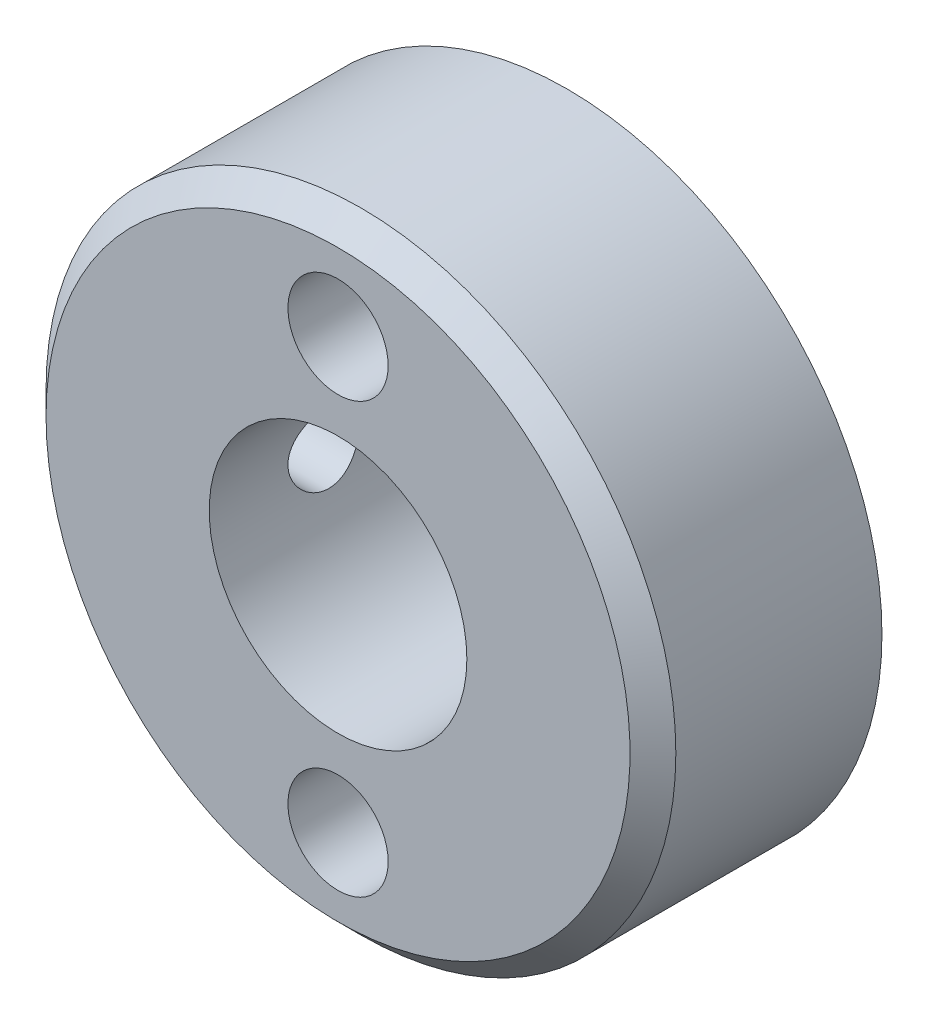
ISO-10303-21;
HEADER;
FILE_DESCRIPTION(('STEP AP214'),'2;1');
FILE_NAME('part.step','',(''),(''),'','','');
FILE_SCHEMA(('AUTOMOTIVE_DESIGN { 1 0 10303 214 1 1 1 1 }'));
ENDSEC;
DATA;
#1=APPLICATION_CONTEXT('core data for automotive mechanical design processes');
#2=APPLICATION_PROTOCOL_DEFINITION('international standard','automotive_design',2000,#1);
#3=PRODUCT_CONTEXT('',#1,'mechanical');
#4=PRODUCT('Part','Part','',(#3));
#5=PRODUCT_RELATED_PRODUCT_CATEGORY('part','',(#4));
#6=PRODUCT_DEFINITION_FORMATION('','',#4);
#7=PRODUCT_DEFINITION_CONTEXT('part definition',#1,'design');
#8=PRODUCT_DEFINITION('design','',#6,#7);
#9=PRODUCT_DEFINITION_SHAPE('','',#8);
#10=(LENGTH_UNIT() NAMED_UNIT(*) SI_UNIT(.MILLI.,.METRE.));
#11=(NAMED_UNIT(*) PLANE_ANGLE_UNIT() SI_UNIT($,.RADIAN.));
#12=(NAMED_UNIT(*) SI_UNIT($,.STERADIAN.) SOLID_ANGLE_UNIT());
#13=UNCERTAINTY_MEASURE_WITH_UNIT(LENGTH_MEASURE(1.E-05),#10,'distance_accuracy_value','');
#14=(GEOMETRIC_REPRESENTATION_CONTEXT(3) GLOBAL_UNCERTAINTY_ASSIGNED_CONTEXT((#13)) GLOBAL_UNIT_ASSIGNED_CONTEXT((#10,
#11,#12)) REPRESENTATION_CONTEXT('',''));
#15=CARTESIAN_POINT('',(0.,0.,0.));
#16=DIRECTION('',(0.,0.,1.));
#17=DIRECTION('',(1.,0.,0.));
#18=AXIS2_PLACEMENT_3D('',#15,#16,#17);
#19=CARTESIAN_POINT('',(0.,0.,0.));
#20=DIRECTION('',(0.,0.,1.));
#21=DIRECTION('',(1.,0.,0.));
#22=AXIS2_PLACEMENT_3D('',#19,#20,#21);
#23=PLANE('',#22);
#24=CARTESIAN_POINT('',(0.,7.5,0.));
#25=DIRECTION('',(0.,0.,1.));
#26=DIRECTION('',(1.,0.,0.));
#27=AXIS2_PLACEMENT_3D('',#24,#25,#26);
#28=CIRCLE('',#27,1.75);
#29=CARTESIAN_POINT('',(1.75,7.5,0.));
#30=VERTEX_POINT('',#29);
#31=EDGE_CURVE('E123',#30,#30,#28,.T.);
#32=ORIENTED_EDGE('',*,*,#31,.F.);
#33=EDGE_LOOP('',(#32));
#34=FACE_BOUND('',#33,.T.);
#35=CARTESIAN_POINT('',(0.,0.,0.));
#36=DIRECTION('',(0.,0.,1.));
#37=DIRECTION('',(1.,0.,0.));
#38=AXIS2_PLACEMENT_3D('',#35,#36,#37);
#39=CIRCLE('',#38,4.5);
#40=CARTESIAN_POINT('',(4.5,0.,0.));
#41=VERTEX_POINT('',#40);
#42=EDGE_CURVE('E121',#41,#41,#39,.T.);
#43=ORIENTED_EDGE('',*,*,#42,.F.);
#44=EDGE_LOOP('',(#43));
#45=FACE_BOUND('',#44,.T.);
#46=CARTESIAN_POINT('',(0.,0.,0.));
#47=DIRECTION('',(0.,0.,1.));
#48=DIRECTION('',(1.,0.,0.));
#49=AXIS2_PLACEMENT_3D('',#46,#47,#48);
#50=CIRCLE('',#49,10.2);
#51=CARTESIAN_POINT('',(-10.2,0.,0.));
#52=VERTEX_POINT('',#51);
#53=EDGE_CURVE('E48',#52,#52,#50,.T.);
#54=ORIENTED_EDGE('',*,*,#53,.T.);
#55=EDGE_LOOP('',(#54));
#56=FACE_BOUND('',#55,.T.);
#57=CARTESIAN_POINT('',(0.,-7.5,0.));
#58=DIRECTION('',(0.,0.,-1.));
#59=DIRECTION('',(1.,0.,0.));
#60=AXIS2_PLACEMENT_3D('',#57,#58,#59);
#61=CIRCLE('',#60,1.75);
#62=CARTESIAN_POINT('',(1.75,-7.5,0.));
#63=VERTEX_POINT('',#62);
#64=EDGE_CURVE('E89',#63,#63,#61,.T.);
#65=ORIENTED_EDGE('',*,*,#64,.T.);
#66=EDGE_LOOP('',(#65));
#67=FACE_BOUND('',#66,.T.);
#68=ADVANCED_FACE('F35',(#34,#45,#56,#67),#23,.T.);
#69=CARTESIAN_POINT('',(0.,0.,-8.));
#70=DIRECTION('',(0.,0.,1.));
#71=DIRECTION('',(1.,0.,0.));
#72=AXIS2_PLACEMENT_3D('',#69,#70,#71);
#73=CYLINDRICAL_SURFACE('',#72,11.);
#74=CARTESIAN_POINT('',(-11.,0.,-5.25));
#75=CARTESIAN_POINT('',(-10.999999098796,-0.069971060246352,-5.24999699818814));
#76=CARTESIAN_POINT('',(-10.9993252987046,-0.139987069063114,-5.24410506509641));
#77=CARTESIAN_POINT('',(-10.996702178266,-0.27807424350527,-5.2206920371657));
#78=CARTESIAN_POINT('',(-10.9947514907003,-0.346143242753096,-5.20315847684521));
#79=CARTESIAN_POINT('',(-10.9897945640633,-0.478317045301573,-5.15698245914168));
#80=CARTESIAN_POINT('',(-10.9867890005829,-0.542424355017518,-5.12834711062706));
#81=CARTESIAN_POINT('',(-10.9800574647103,-0.664910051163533,-5.06079510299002));
#82=CARTESIAN_POINT('',(-10.9763316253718,-0.723289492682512,-5.02188034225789));
#83=CARTESIAN_POINT('',(-10.968557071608,-0.832943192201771,-4.93468294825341));
#84=CARTESIAN_POINT('',(-10.9645070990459,-0.884187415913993,-4.88636265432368));
#85=CARTESIAN_POINT('',(-10.9565510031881,-0.9778576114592,-4.78180649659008));
#86=CARTESIAN_POINT('',(-10.9526448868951,-1.0202831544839,-4.72557024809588));
#87=CARTESIAN_POINT('',(-10.9454062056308,-1.09522113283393,-4.60658651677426));
#88=CARTESIAN_POINT('',(-10.9420752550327,-1.12770585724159,-4.54382147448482));
#89=CARTESIAN_POINT('',(-10.9363802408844,-1.18166312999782,-4.41368303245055));
#90=CARTESIAN_POINT('',(-10.9340161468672,-1.20313602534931,-4.34630977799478));
#91=CARTESIAN_POINT('',(-10.9305342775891,-1.23436981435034,-4.20917683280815));
#92=CARTESIAN_POINT('',(-10.9294111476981,-1.24418104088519,-4.13942874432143));
#93=CARTESIAN_POINT('',(-10.928521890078,-1.25196865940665,-3.99926759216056));
#94=CARTESIAN_POINT('',(-10.9287557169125,-1.24994544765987,-3.92885455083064));
#95=CARTESIAN_POINT('',(-10.9305490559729,-1.23416301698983,-3.7897111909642));
#96=CARTESIAN_POINT('',(-10.9321023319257,-1.22045900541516,-3.72097451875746));
#97=CARTESIAN_POINT('',(-10.9363498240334,-1.18179000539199,-3.58678297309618));
#98=CARTESIAN_POINT('',(-10.9390440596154,-1.15682482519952,-3.52132815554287));
#99=CARTESIAN_POINT('',(-10.9452770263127,-1.09628205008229,-3.39538543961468));
#100=CARTESIAN_POINT('',(-10.9488176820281,-1.0606802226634,-3.33490928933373));
#101=CARTESIAN_POINT('',(-10.9563429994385,-0.979892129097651,-3.22076925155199));
#102=CARTESIAN_POINT('',(-10.9603276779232,-0.934705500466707,-3.16710562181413));
#103=CARTESIAN_POINT('',(-10.9683198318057,-0.83572337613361,-3.06779331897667));
#104=CARTESIAN_POINT('',(-10.9723273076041,-0.781880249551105,-3.02219210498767));
#105=CARTESIAN_POINT('',(-10.9798921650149,-0.667278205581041,-2.94066779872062));
#106=CARTESIAN_POINT('',(-10.9834495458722,-0.606519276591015,-2.90474472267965));
#107=CARTESIAN_POINT('',(-10.9897150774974,-0.479775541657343,-2.84359731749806));
#108=CARTESIAN_POINT('',(-10.9924230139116,-0.413789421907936,-2.818375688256));
#109=CARTESIAN_POINT('',(-10.9966825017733,-0.27848120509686,-2.77938340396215));
#110=CARTESIAN_POINT('',(-10.9982340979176,-0.209159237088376,-2.76561230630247));
#111=CARTESIAN_POINT('',(-11.0000003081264,-0.0695577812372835,-2.74997287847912));
#112=CARTESIAN_POINT('',(-11.0002222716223,0.000714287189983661,-2.74803911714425));
#113=CARTESIAN_POINT('',(-10.9993239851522,0.140581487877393,-2.75595697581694));
#114=CARTESIAN_POINT('',(-10.9982037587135,0.210176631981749,-2.76580838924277));
#115=CARTESIAN_POINT('',(-10.994751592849,0.346523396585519,-2.79696262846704));
#116=CARTESIAN_POINT('',(-10.9924229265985,0.413282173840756,-2.81823452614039));
#117=CARTESIAN_POINT('',(-10.9868148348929,0.542284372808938,-2.87159392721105));
#118=CARTESIAN_POINT('',(-10.9835353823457,0.604527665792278,-2.90368173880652));
#119=CARTESIAN_POINT('',(-10.9763735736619,0.72302600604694,-2.97792232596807));
#120=CARTESIAN_POINT('',(-10.9724886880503,0.77925417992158,-3.02011774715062));
#121=CARTESIAN_POINT('',(-10.9645592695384,0.883853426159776,-3.11331505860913));
#122=CARTESIAN_POINT('',(-10.9605147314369,0.932224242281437,-3.16431723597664));
#123=CARTESIAN_POINT('',(-10.9526994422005,1.01996547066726,-3.27396722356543));
#124=CARTESIAN_POINT('',(-10.9489300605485,1.05929271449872,-3.33264968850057));
#125=CARTESIAN_POINT('',(-10.942113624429,1.12753292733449,-3.45582498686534));
#126=CARTESIAN_POINT('',(-10.9390665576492,1.1564460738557,-3.5203177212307));
#127=CARTESIAN_POINT('',(-10.9340487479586,1.20296631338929,-3.65313935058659));
#128=CARTESIAN_POINT('',(-10.9320756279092,1.22059839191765,-3.72145940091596));
#129=CARTESIAN_POINT('',(-10.9294220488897,1.2441367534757,-3.86011418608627));
#130=CARTESIAN_POINT('',(-10.9287415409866,1.25004348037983,-3.93044884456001));
#131=CARTESIAN_POINT('',(-10.9287514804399,1.24995628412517,-4.07070705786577));
#132=CARTESIAN_POINT('',(-10.9294341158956,1.2440301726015,-4.14063066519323));
#133=CARTESIAN_POINT('',(-10.9320766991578,1.22058843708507,-4.27848162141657));
#134=CARTESIAN_POINT('',(-10.9340366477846,1.20307280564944,-4.34640896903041));
#135=CARTESIAN_POINT('',(-10.9390107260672,1.15696926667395,-4.4783342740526));
#136=CARTESIAN_POINT('',(-10.9420246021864,1.12838402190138,-4.5423331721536));
#137=CARTESIAN_POINT('',(-10.9487674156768,1.06095945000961,-4.66463624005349));
#138=CARTESIAN_POINT('',(-10.9524963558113,1.0221200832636,-4.72294038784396));
#139=CARTESIAN_POINT('',(-10.9602747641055,0.935036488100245,-4.83254612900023));
#140=CARTESIAN_POINT('',(-10.96432588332,0.886741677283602,-4.8838074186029));
#141=CARTESIAN_POINT('',(-10.972277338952,0.782221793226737,-4.97752568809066));
#142=CARTESIAN_POINT('',(-10.9761776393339,0.725994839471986,-5.01998057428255));
#143=CARTESIAN_POINT('',(-10.9834013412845,0.607005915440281,-5.09499201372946));
#144=CARTESIAN_POINT('',(-10.9867228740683,0.54422378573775,-5.12751674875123));
#145=CARTESIAN_POINT('',(-10.9923953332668,0.414088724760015,-5.18151706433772));
#146=CARTESIAN_POINT('',(-10.9947473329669,0.346740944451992,-5.20300486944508));
#147=CARTESIAN_POINT('',(-10.9976371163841,0.232523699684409,-5.2290739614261));
#148=CARTESIAN_POINT('',(-10.9985189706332,0.18637950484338,-5.23691021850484));
#149=CARTESIAN_POINT('',(-10.9997007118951,0.0934968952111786,-5.24737422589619));
#150=CARTESIAN_POINT('',(-11.0000006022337,0.0467584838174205,-5.25000200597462));
#151=CARTESIAN_POINT('',(-11.,0.,-5.25));
#152=B_SPLINE_CURVE_WITH_KNOTS('',3,(#74,#75,#76,#77,#78,#79,#80,#81,#82,#83,#84,#85,#86,#87,
#88,#89,#90,#91,#92,#93,#94,#95,#96,#97,#98,#99,#100,#101,#102,#103,#104,#105,#106,#107,#108,
#109,#110,#111,#112,#113,#114,#115,#116,#117,#118,#119,#120,#121,#122,#123,#124,#125,#126,#127,
#128,#129,#130,#131,#132,#133,#134,#135,#136,#137,#138,#139,#140,#141,#142,#143,#144,#145,#146,
#147,#148,#149,#150,#151),.UNSPECIFIED.,.T.,.F.,(4,2,2,2,2,2,2,2,2,2,2,2,2,2,2,2,2,2,2,2,2,2,2,
2,2,2,2,2,2,2,2,2,2,2,2,2,2,2,4),(0.,0.209742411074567,0.419709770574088,0.629542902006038,
0.839337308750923,1.04998970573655,1.26065234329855,1.47189698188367,1.68313496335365,
1.89345787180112,2.10377373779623,2.31310105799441,2.52243194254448,2.73224341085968,
2.94206281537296,3.15307892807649,3.36409539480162,3.57516506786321,3.78622658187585,
3.99612038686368,4.20601051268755,4.41533507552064,4.62466560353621,4.83489538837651,
5.04513202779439,5.25635228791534,5.4675689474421,5.67831616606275,5.88905540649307,
6.09859040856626,6.30812554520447,6.51761030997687,6.72709588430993,6.9377343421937,
7.14842282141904,7.35977947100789,7.57090151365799,7.71106364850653,7.85122498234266),.UNSPECIFIED.);
#153=CARTESIAN_POINT('',(-11.,0.,-5.25));
#154=VERTEX_POINT('',#153);
#155=EDGE_CURVE('E82',#154,#154,#152,.T.);
#156=ORIENTED_EDGE('',*,*,#155,.F.);
#157=EDGE_LOOP('',(#156));
#158=FACE_BOUND('',#157,.T.);
#159=CARTESIAN_POINT('',(0.,0.,-0.799999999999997));
#160=DIRECTION('',(0.,0.,1.));
#161=DIRECTION('',(1.,0.,0.));
#162=AXIS2_PLACEMENT_3D('',#159,#160,#161);
#163=CIRCLE('',#162,11.);
#164=CARTESIAN_POINT('',(-11.,0.,-0.799999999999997));
#165=VERTEX_POINT('',#164);
#166=EDGE_CURVE('E11',#165,#165,#163,.F.);
#167=ORIENTED_EDGE('',*,*,#166,.T.);
#168=EDGE_LOOP('',(#167));
#169=FACE_BOUND('',#168,.T.);
#170=CARTESIAN_POINT('',(0.,0.,-8.));
#171=DIRECTION('',(0.,0.,1.));
#172=DIRECTION('',(1.,0.,0.));
#173=AXIS2_PLACEMENT_3D('',#170,#171,#172);
#174=CIRCLE('',#173,11.);
#175=CARTESIAN_POINT('',(11.,0.,-8.));
#176=VERTEX_POINT('',#175);
#177=EDGE_CURVE('E122',#176,#176,#174,.T.);
#178=ORIENTED_EDGE('',*,*,#177,.T.);
#179=EDGE_LOOP('',(#178));
#180=FACE_BOUND('',#179,.T.);
#181=ADVANCED_FACE('F67',(#158,#169,#180),#73,.T.);
#182=CARTESIAN_POINT('',(0.,0.,-8.));
#183=DIRECTION('',(0.,0.,1.));
#184=DIRECTION('',(1.,0.,0.));
#185=AXIS2_PLACEMENT_3D('',#182,#183,#184);
#186=PLANE('',#185);
#187=CARTESIAN_POINT('',(0.,0.,-8.));
#188=DIRECTION('',(0.,0.,1.));
#189=DIRECTION('',(1.,0.,0.));
#190=AXIS2_PLACEMENT_3D('',#187,#188,#189);
#191=CIRCLE('',#190,5.3);
#192=CARTESIAN_POINT('',(5.3,0.,-8.));
#193=VERTEX_POINT('',#192);
#194=EDGE_CURVE('E126',#193,#193,#191,.T.);
#195=ORIENTED_EDGE('',*,*,#194,.T.);
#196=EDGE_LOOP('',(#195));
#197=FACE_BOUND('',#196,.T.);
#198=ORIENTED_EDGE('',*,*,#177,.F.);
#199=EDGE_LOOP('',(#198));
#200=FACE_BOUND('',#199,.T.);
#201=ADVANCED_FACE('F73',(#197,#200),#186,.F.);
#202=CARTESIAN_POINT('',(0.,0.,-8.));
#203=DIRECTION('',(0.,0.,1.));
#204=DIRECTION('',(1.,0.,0.));
#205=AXIS2_PLACEMENT_3D('',#202,#203,#204);
#206=CYLINDRICAL_SURFACE('',#205,4.5);
#207=CARTESIAN_POINT('',(-4.5,0.,-5.25));
#208=CARTESIAN_POINT('',(-4.49999908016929,-0.0688012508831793,-5.24999860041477));
#209=CARTESIAN_POINT('',(-4.49840674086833,-0.137617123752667,-5.24430068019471));
#210=CARTESIAN_POINT('',(-4.49220950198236,-0.273259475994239,-5.22170427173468));
#211=CARTESIAN_POINT('',(-4.48760333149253,-0.340085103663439,-5.20480105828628));
#212=CARTESIAN_POINT('',(-4.47588565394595,-0.469769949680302,-5.16039128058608));
#213=CARTESIAN_POINT('',(-4.46877753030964,-0.53263439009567,-5.13289903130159));
#214=CARTESIAN_POINT('',(-4.45280312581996,-0.652860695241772,-5.06814649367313));
#215=CARTESIAN_POINT('',(-4.44393668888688,-0.710222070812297,-5.03088533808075));
#216=CARTESIAN_POINT('',(-4.4251515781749,-0.819246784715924,-4.94667056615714));
#217=CARTESIAN_POINT('',(-4.41521373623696,-0.870753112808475,-4.89951796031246));
#218=CARTESIAN_POINT('',(-4.39552607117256,-0.965238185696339,-4.79728372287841));
#219=CARTESIAN_POINT('',(-4.38577627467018,-1.00821573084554,-4.74220097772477));
#220=CARTESIAN_POINT('',(-4.36737044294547,-1.08520808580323,-4.62439273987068));
#221=CARTESIAN_POINT('',(-4.35873847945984,-1.11903874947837,-4.56154279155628));
#222=CARTESIAN_POINT('',(-4.34382900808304,-1.1755895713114,-4.43076808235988));
#223=CARTESIAN_POINT('',(-4.33755102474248,-1.19831197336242,-4.36284434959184));
#224=CARTESIAN_POINT('',(-4.32825883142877,-1.23144924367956,-4.22559721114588));
#225=CARTESIAN_POINT('',(-4.32516886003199,-1.24215036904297,-4.15634817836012));
#226=CARTESIAN_POINT('',(-4.32237649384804,-1.25183427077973,-4.01697411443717));
#227=CARTESIAN_POINT('',(-4.3226734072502,-1.25081944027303,-3.9468492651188));
#228=CARTESIAN_POINT('',(-4.32655366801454,-1.2373267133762,-3.80997772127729));
#229=CARTESIAN_POINT('',(-4.33003660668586,-1.22519902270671,-3.74319319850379));
#230=CARTESIAN_POINT('',(-4.33973517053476,-1.19038731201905,-3.6126463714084));
#231=CARTESIAN_POINT('',(-4.34595103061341,-1.16770238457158,-3.54888432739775));
#232=CARTESIAN_POINT('',(-4.36050069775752,-1.11214373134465,-3.42529776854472));
#233=CARTESIAN_POINT('',(-4.36885918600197,-1.07915021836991,-3.36553013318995));
#234=CARTESIAN_POINT('',(-4.386739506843,-1.00399440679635,-3.25225842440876));
#235=CARTESIAN_POINT('',(-4.39626158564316,-0.961830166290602,-3.19875568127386));
#236=CARTESIAN_POINT('',(-4.41581072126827,-0.867755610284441,-3.09753611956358));
#237=CARTESIAN_POINT('',(-4.42584370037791,-0.815552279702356,-3.05009236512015));
#238=CARTESIAN_POINT('',(-4.44498199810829,-0.703806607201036,-2.96457426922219));
#239=CARTESIAN_POINT('',(-4.45408727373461,-0.644263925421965,-2.92650036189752));
#240=CARTESIAN_POINT('',(-4.47040839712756,-0.519083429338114,-2.86066818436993));
#241=CARTESIAN_POINT('',(-4.47761448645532,-0.453416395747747,-2.83296289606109));
#242=CARTESIAN_POINT('',(-4.48925492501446,-0.318109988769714,-2.78906590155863));
#243=CARTESIAN_POINT('',(-4.493689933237,-0.24847156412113,-2.77287145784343));
#244=CARTESIAN_POINT('',(-4.49918736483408,-0.109526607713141,-2.75289286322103));
#245=CARTESIAN_POINT('',(-4.5003505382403,-0.0402773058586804,-2.74873785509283));
#246=CARTESIAN_POINT('',(-4.4994648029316,0.0979299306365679,-2.75192699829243));
#247=CARTESIAN_POINT('',(-4.49741625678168,0.166887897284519,-2.75926985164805));
#248=CARTESIAN_POINT('',(-4.49040265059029,0.301206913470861,-2.78494333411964));
#249=CARTESIAN_POINT('',(-4.48549337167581,0.366611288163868,-2.80306394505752));
#250=CARTESIAN_POINT('',(-4.47331829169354,0.493443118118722,-2.8495318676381));
#251=CARTESIAN_POINT('',(-4.46605222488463,0.554870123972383,-2.87788033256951));
#252=CARTESIAN_POINT('',(-4.44973740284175,0.673420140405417,-2.94466587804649));
#253=CARTESIAN_POINT('',(-4.44065471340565,0.730427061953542,-2.98330052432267));
#254=CARTESIAN_POINT('',(-4.42175477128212,0.837277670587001,-3.06931613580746));
#255=CARTESIAN_POINT('',(-4.41193736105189,0.887119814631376,-3.11669898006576));
#256=CARTESIAN_POINT('',(-4.39229842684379,0.979812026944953,-3.22060144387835));
#257=CARTESIAN_POINT('',(-4.3824860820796,1.02239957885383,-3.27735745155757));
#258=CARTESIAN_POINT('',(-4.36429693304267,1.09745581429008,-3.39742063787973));
#259=CARTESIAN_POINT('',(-4.35592007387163,1.12992488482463,-3.4607275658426));
#260=CARTESIAN_POINT('',(-4.34164798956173,1.18358105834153,-3.59180716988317));
#261=CARTESIAN_POINT('',(-4.3357390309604,1.20483077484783,-3.65955263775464));
#262=CARTESIAN_POINT('',(-4.32707876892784,1.23557652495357,-3.79784970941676));
#263=CARTESIAN_POINT('',(-4.32432657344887,1.24507587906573,-3.86840051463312));
#264=CARTESIAN_POINT('',(-4.32237038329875,1.25184859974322,-4.00760577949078));
#265=CARTESIAN_POINT('',(-4.32304340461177,1.24954571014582,-4.07623819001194));
#266=CARTESIAN_POINT('',(-4.32757137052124,1.23377143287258,-4.21209489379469));
#267=CARTESIAN_POINT('',(-4.33142621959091,1.22030038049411,-4.27931922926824));
#268=CARTESIAN_POINT('',(-4.34180718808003,1.18282724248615,-4.40986723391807));
#269=CARTESIAN_POINT('',(-4.34830866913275,1.15892214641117,-4.47322084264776));
#270=CARTESIAN_POINT('',(-4.36324916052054,1.10133451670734,-4.59506742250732));
#271=CARTESIAN_POINT('',(-4.37168849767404,1.06765033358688,-4.65355957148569));
#272=CARTESIAN_POINT('',(-4.38988810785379,0.990206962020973,-4.76602765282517));
#273=CARTESIAN_POINT('',(-4.39968178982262,0.946162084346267,-4.81980147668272));
#274=CARTESIAN_POINT('',(-4.41930831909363,0.849781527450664,-4.91933237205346));
#275=CARTESIAN_POINT('',(-4.42914117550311,0.797443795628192,-4.96508745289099));
#276=CARTESIAN_POINT('',(-4.44801839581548,0.684460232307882,-5.04835813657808));
#277=CARTESIAN_POINT('',(-4.45703841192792,0.623646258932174,-5.08565162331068));
#278=CARTESIAN_POINT('',(-4.47299974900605,0.496361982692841,-5.14942813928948));
#279=CARTESIAN_POINT('',(-4.47994229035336,0.429895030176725,-5.17591751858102));
#280=CARTESIAN_POINT('',(-4.4901607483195,0.3031454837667,-5.2142200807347));
#281=CARTESIAN_POINT('',(-4.49382245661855,0.243364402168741,-5.22760478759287));
#282=CARTESIAN_POINT('',(-4.49874234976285,0.122392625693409,-5.24549484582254));
#283=CARTESIAN_POINT('',(-4.50000081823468,0.0612020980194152,-5.25000124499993));
#284=CARTESIAN_POINT('',(-4.5,0.,-5.25));
#285=B_SPLINE_CURVE_WITH_KNOTS('',3,(#207,#208,#209,#210,#211,#212,#213,#214,#215,#216,#217,
#218,#219,#220,#221,#222,#223,#224,#225,#226,#227,#228,#229,#230,#231,#232,#233,#234,#235,#236,
#237,#238,#239,#240,#241,#242,#243,#244,#245,#246,#247,#248,#249,#250,#251,#252,#253,#254,#255,
#256,#257,#258,#259,#260,#261,#262,#263,#264,#265,#266,#267,#268,#269,#270,#271,#272,#273,#274,
#275,#276,#277,#278,#279,#280,#281,#282,#283,#284),.UNSPECIFIED.,.T.,.F.,(4,2,2,2,2,2,2,2,2,2,2,
2,2,2,2,2,2,2,2,2,2,2,2,2,2,2,2,2,2,2,2,2,2,2,2,2,2,2,4),(0.,0.206179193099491,
0.412445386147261,0.618433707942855,0.824440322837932,1.03507624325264,1.24574177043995,
1.46037690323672,1.67496866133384,1.8843343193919,2.09365721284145,2.29660232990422,
2.49956489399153,2.70497960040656,2.91043784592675,3.12319493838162,3.33596188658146,
3.5498016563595,3.76359055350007,3.97072010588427,4.17782627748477,4.38102317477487,
4.58424299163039,4.79168948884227,4.99918059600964,5.21305991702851,5.42693105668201,
5.63959564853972,5.85220013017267,6.05722599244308,6.26224569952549,6.46539893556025,
6.66858645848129,6.87821913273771,7.0879037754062,7.30258090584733,7.51713167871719,
7.7005598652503,7.88396640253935),.UNSPECIFIED.);
#286=CARTESIAN_POINT('',(-4.5,0.,-5.25));
#287=VERTEX_POINT('',#286);
#288=EDGE_CURVE('E39',#287,#287,#285,.T.);
#289=ORIENTED_EDGE('',*,*,#288,.T.);
#290=EDGE_LOOP('',(#289));
#291=FACE_BOUND('',#290,.T.);
#292=CARTESIAN_POINT('',(0.,0.,-7.2));
#293=DIRECTION('',(0.,0.,1.));
#294=DIRECTION('',(1.,0.,0.));
#295=AXIS2_PLACEMENT_3D('',#292,#293,#294);
#296=CIRCLE('',#295,4.5);
#297=CARTESIAN_POINT('',(4.5,0.,-7.2));
#298=VERTEX_POINT('',#297);
#299=EDGE_CURVE('E118',#298,#298,#296,.F.);
#300=ORIENTED_EDGE('',*,*,#299,.T.);
#301=EDGE_LOOP('',(#300));
#302=FACE_BOUND('',#301,.T.);
#303=ORIENTED_EDGE('',*,*,#42,.T.);
#304=EDGE_LOOP('',(#303));
#305=FACE_BOUND('',#304,.T.);
#306=ADVANCED_FACE('F103',(#291,#302,#305),#206,.F.);
#307=CARTESIAN_POINT('',(0.,7.5,6.07031033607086));
#308=DIRECTION('',(0.,0.,1.));
#309=DIRECTION('',(1.,0.,0.));
#310=AXIS2_PLACEMENT_3D('',#307,#308,#309);
#311=CYLINDRICAL_SURFACE('',#310,1.75);
#312=ORIENTED_EDGE('',*,*,#31,.T.);
#313=EDGE_LOOP('',(#312));
#314=FACE_BOUND('',#313,.T.);
#315=CARTESIAN_POINT('',(0.,7.5,-4.));
#316=DIRECTION('',(0.,0.,1.));
#317=DIRECTION('',(1.,0.,0.));
#318=AXIS2_PLACEMENT_3D('',#315,#316,#317);
#319=CIRCLE('',#318,1.75);
#320=CARTESIAN_POINT('',(1.75,7.5,-4.));
#321=VERTEX_POINT('',#320);
#322=EDGE_CURVE('E88',#321,#321,#319,.T.);
#323=ORIENTED_EDGE('',*,*,#322,.F.);
#324=EDGE_LOOP('',(#323));
#325=FACE_BOUND('',#324,.T.);
#326=ADVANCED_FACE('F100',(#314,#325),#311,.F.);
#327=CARTESIAN_POINT('',(0.,7.5,-5.01036297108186));
#328=DIRECTION('',(0.,0.,1.));
#329=DIRECTION('',(1.,0.,0.));
#330=AXIS2_PLACEMENT_3D('',#327,#328,#329);
#331=CONICAL_SURFACE('',#330,0.,1.04719755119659);
#332=ORIENTED_EDGE('',*,*,#322,.T.);
#333=EDGE_LOOP('',(#332));
#334=FACE_BOUND('',#333,.T.);
#335=CARTESIAN_POINT('',(0.,7.5,-5.01036297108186));
#336=VERTEX_POINT('',#335);
#337=VERTEX_LOOP('',#336);
#338=FACE_BOUND('',#337,.T.);
#339=ADVANCED_FACE('F96',(#334,#338),#331,.F.);
#340=CARTESIAN_POINT('',(0.,0.,-8.));
#341=DIRECTION('',(0.,0.,-1.));
#342=DIRECTION('',(-1.,0.,0.));
#343=AXIS2_PLACEMENT_3D('',#340,#341,#342);
#344=CONICAL_SURFACE('',#343,5.3,0.785398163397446);
#345=ORIENTED_EDGE('',*,*,#299,.F.);
#346=EDGE_LOOP('',(#345));
#347=FACE_BOUND('',#346,.T.);
#348=ORIENTED_EDGE('',*,*,#194,.F.);
#349=EDGE_LOOP('',(#348));
#350=FACE_BOUND('',#349,.T.);
#351=ADVANCED_FACE('F80',(#347,#350),#344,.F.);
#352=CARTESIAN_POINT('',(0.,0.,0.));
#353=DIRECTION('',(0.,0.,-1.));
#354=DIRECTION('',(-1.,0.,0.));
#355=AXIS2_PLACEMENT_3D('',#352,#353,#354);
#356=CONICAL_SURFACE('',#355,10.2,0.785398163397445);
#357=CARTESIAN_POINT('',(-11.,0.,-0.799999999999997));
#358=CARTESIAN_POINT('',(-10.9916666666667,0.,-0.791666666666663));
#359=CARTESIAN_POINT('',(-10.9833333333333,0.,-0.78333333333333));
#360=CARTESIAN_POINT('',(-10.9666666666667,0.,-0.766666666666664));
#361=CARTESIAN_POINT('',(-10.9583333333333,0.,-0.758333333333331));
#362=CARTESIAN_POINT('',(-10.9416666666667,0.,-0.741666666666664));
#363=CARTESIAN_POINT('',(-10.9333333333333,0.,-0.73333333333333));
#364=CARTESIAN_POINT('',(-10.9166666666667,0.,-0.716666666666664));
#365=CARTESIAN_POINT('',(-10.9083333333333,0.,-0.708333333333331));
#366=CARTESIAN_POINT('',(-10.8916666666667,0.,-0.691666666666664));
#367=CARTESIAN_POINT('',(-10.8833333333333,0.,-0.683333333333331));
#368=CARTESIAN_POINT('',(-10.8666666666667,0.,-0.666666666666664));
#369=CARTESIAN_POINT('',(-10.8583333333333,0.,-0.658333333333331));
#370=CARTESIAN_POINT('',(-10.8416666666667,0.,-0.641666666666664));
#371=CARTESIAN_POINT('',(-10.8333333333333,0.,-0.633333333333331));
#372=CARTESIAN_POINT('',(-10.8166666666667,0.,-0.616666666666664));
#373=CARTESIAN_POINT('',(-10.8083333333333,0.,-0.608333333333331));
#374=CARTESIAN_POINT('',(-10.7916666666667,0.,-0.591666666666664));
#375=CARTESIAN_POINT('',(-10.7833333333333,0.,-0.583333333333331));
#376=CARTESIAN_POINT('',(-10.7666666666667,0.,-0.566666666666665));
#377=CARTESIAN_POINT('',(-10.7583333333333,0.,-0.558333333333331));
#378=CARTESIAN_POINT('',(-10.7416666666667,0.,-0.541666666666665));
#379=CARTESIAN_POINT('',(-10.7333333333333,0.,-0.533333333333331));
#380=CARTESIAN_POINT('',(-10.7166666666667,0.,-0.516666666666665));
#381=CARTESIAN_POINT('',(-10.7083333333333,0.,-0.508333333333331));
#382=CARTESIAN_POINT('',(-10.6916666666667,0.,-0.491666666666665));
#383=CARTESIAN_POINT('',(-10.6833333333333,0.,-0.483333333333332));
#384=CARTESIAN_POINT('',(-10.6666666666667,0.,-0.466666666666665));
#385=CARTESIAN_POINT('',(-10.6583333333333,0.,-0.458333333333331));
#386=CARTESIAN_POINT('',(-10.6416666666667,0.,-0.441666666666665));
#387=CARTESIAN_POINT('',(-10.6333333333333,0.,-0.433333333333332));
#388=CARTESIAN_POINT('',(-10.6166666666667,0.,-0.416666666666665));
#389=CARTESIAN_POINT('',(-10.6083333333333,0.,-0.408333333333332));
#390=CARTESIAN_POINT('',(-10.5916666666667,0.,-0.391666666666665));
#391=CARTESIAN_POINT('',(-10.5833333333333,0.,-0.383333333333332));
#392=CARTESIAN_POINT('',(-10.5666666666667,0.,-0.366666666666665));
#393=CARTESIAN_POINT('',(-10.5583333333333,0.,-0.358333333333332));
#394=CARTESIAN_POINT('',(-10.5416666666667,0.,-0.341666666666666));
#395=CARTESIAN_POINT('',(-10.5333333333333,0.,-0.333333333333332));
#396=CARTESIAN_POINT('',(-10.5166666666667,0.,-0.316666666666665));
#397=CARTESIAN_POINT('',(-10.5083333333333,0.,-0.308333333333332));
#398=CARTESIAN_POINT('',(-10.4916666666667,0.,-0.291666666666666));
#399=CARTESIAN_POINT('',(-10.4833333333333,0.,-0.283333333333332));
#400=CARTESIAN_POINT('',(-10.4666666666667,0.,-0.266666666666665));
#401=CARTESIAN_POINT('',(-10.4583333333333,0.,-0.258333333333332));
#402=CARTESIAN_POINT('',(-10.4416666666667,0.,-0.241666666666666));
#403=CARTESIAN_POINT('',(-10.4333333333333,0.,-0.233333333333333));
#404=CARTESIAN_POINT('',(-10.4166666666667,0.,-0.216666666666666));
#405=CARTESIAN_POINT('',(-10.4083333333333,0.,-0.208333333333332));
#406=CARTESIAN_POINT('',(-10.3916666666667,0.,-0.191666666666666));
#407=CARTESIAN_POINT('',(-10.3833333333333,0.,-0.183333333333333));
#408=CARTESIAN_POINT('',(-10.3666666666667,0.,-0.166666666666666));
#409=CARTESIAN_POINT('',(-10.3583333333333,0.,-0.158333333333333));
#410=CARTESIAN_POINT('',(-10.3416666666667,0.,-0.141666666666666));
#411=CARTESIAN_POINT('',(-10.3333333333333,0.,-0.133333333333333));
#412=CARTESIAN_POINT('',(-10.3166666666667,0.,-0.116666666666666));
#413=CARTESIAN_POINT('',(-10.3083333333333,0.,-0.108333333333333));
#414=CARTESIAN_POINT('',(-10.2916666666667,0.,-0.0916666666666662));
#415=CARTESIAN_POINT('',(-10.2833333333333,0.,-0.0833333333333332));
#416=CARTESIAN_POINT('',(-10.2666666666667,0.,-0.0666666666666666));
#417=CARTESIAN_POINT('',(-10.2583333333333,0.,-0.058333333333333));
#418=CARTESIAN_POINT('',(-10.2416666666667,0.,-0.0416666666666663));
#419=CARTESIAN_POINT('',(-10.2333333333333,0.,-0.0333333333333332));
#420=CARTESIAN_POINT('',(-10.2166666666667,0.,-0.016666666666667));
#421=CARTESIAN_POINT('',(-10.2083333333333,0.,-0.00833333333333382));
#422=CARTESIAN_POINT('',(-10.2,0.,0.));
#423=B_SPLINE_CURVE_WITH_KNOTS('',3,(#357,#358,#359,#360,#361,#362,#363,#364,#365,#366,#367,
#368,#369,#370,#371,#372,#373,#374,#375,#376,#377,#378,#379,#380,#381,#382,#383,#384,#385,#386,
#387,#388,#389,#390,#391,#392,#393,#394,#395,#396,#397,#398,#399,#400,#401,#402,#403,#404,#405,
#406,#407,#408,#409,#410,#411,#412,#413,#414,#415,#416,#417,#418,#419,#420,#421,#422),
.UNSPECIFIED.,.F.,.F.,(4,2,2,2,2,2,2,2,2,2,2,2,2,2,2,2,2,2,2,2,2,2,2,2,2,2,2,2,2,2,2,2,4),(0.,
0.0353553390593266,0.0707106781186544,0.106066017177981,0.141421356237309,0.176776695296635,
0.212132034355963,0.24748737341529,0.282842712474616,0.318198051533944,0.353553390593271,
0.388908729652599,0.424264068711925,0.459619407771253,0.49497474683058,0.530330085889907,
0.565685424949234,0.601040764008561,0.636396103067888,0.671751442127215,0.707106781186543,
0.74246212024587,0.777817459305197,0.813172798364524,0.84852813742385,0.883883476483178,
0.919238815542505,0.954594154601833,0.989949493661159,1.02530483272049,1.06066017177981,
1.09601551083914,1.13137084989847),.UNSPECIFIED.);
#424=EDGE_CURVE('BSEAM37',#165,#52,#423,.T.);
#425=ORIENTED_EDGE('',*,*,#166,.F.);
#426=ORIENTED_EDGE('',*,*,#53,.F.);
#427=ORIENTED_EDGE('',*,*,#424,.T.);
#428=ORIENTED_EDGE('',*,*,#424,.F.);
#429=EDGE_LOOP('',(#425,#427,#426,#428));
#430=FACE_BOUND('',#429,.T.);
#431=ADVANCED_FACE('F37',(#430),#356,.T.);
#432=CARTESIAN_POINT('',(-11.,0.,-4.));
#433=DIRECTION('',(1.,0.,0.));
#434=DIRECTION('',(0.,0.,-1.));
#435=AXIS2_PLACEMENT_3D('',#432,#433,#434);
#436=CYLINDRICAL_SURFACE('',#435,1.25);
#437=ORIENTED_EDGE('',*,*,#155,.T.);
#438=EDGE_LOOP('',(#437));
#439=FACE_BOUND('',#438,.T.);
#440=ORIENTED_EDGE('',*,*,#288,.F.);
#441=EDGE_LOOP('',(#440));
#442=FACE_BOUND('',#441,.T.);
#443=ADVANCED_FACE('F62',(#439,#442),#436,.F.);
#444=CARTESIAN_POINT('',(0.,-7.5,6.07031033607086));
#445=DIRECTION('',(0.,0.,1.));
#446=DIRECTION('',(1.,0.,0.));
#447=AXIS2_PLACEMENT_3D('',#444,#445,#446);
#448=CYLINDRICAL_SURFACE('',#447,1.75);
#449=ORIENTED_EDGE('',*,*,#64,.F.);
#450=EDGE_LOOP('',(#449));
#451=FACE_BOUND('',#450,.T.);
#452=CARTESIAN_POINT('',(0.,-7.5,-4.));
#453=DIRECTION('',(0.,0.,-1.));
#454=DIRECTION('',(1.,0.,0.));
#455=AXIS2_PLACEMENT_3D('',#452,#453,#454);
#456=CIRCLE('',#455,1.75);
#457=CARTESIAN_POINT('',(1.75,-7.5,-4.));
#458=VERTEX_POINT('',#457);
#459=EDGE_CURVE('E219',#458,#458,#456,.T.);
#460=ORIENTED_EDGE('',*,*,#459,.T.);
#461=EDGE_LOOP('',(#460));
#462=FACE_BOUND('',#461,.T.);
#463=ADVANCED_FACE('F56',(#451,#462),#448,.F.);
#464=CARTESIAN_POINT('',(0.,-7.5,-5.01036297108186));
#465=DIRECTION('',(0.,0.,1.));
#466=DIRECTION('',(1.,0.,0.));
#467=AXIS2_PLACEMENT_3D('',#464,#465,#466);
#468=CONICAL_SURFACE('',#467,0.,1.04719755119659);
#469=ORIENTED_EDGE('',*,*,#459,.F.);
#470=EDGE_LOOP('',(#469));
#471=FACE_BOUND('',#470,.T.);
#472=CARTESIAN_POINT('',(0.,-7.5,-5.01036297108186));
#473=VERTEX_POINT('',#472);
#474=VERTEX_LOOP('',#473);
#475=FACE_BOUND('',#474,.T.);
#476=ADVANCED_FACE('F54',(#471,#475),#468,.F.);
#477=CLOSED_SHELL('',(#68,#181,#201,#306,#326,#339,#351,#431,#443,#463,#476));
#478=MANIFOLD_SOLID_BREP('B2',#477);
#479=ADVANCED_BREP_SHAPE_REPRESENTATION('',(#18,#478),#14);
#480=SHAPE_DEFINITION_REPRESENTATION(#9,#479);
ENDSEC;
END-ISO-10303-21;
